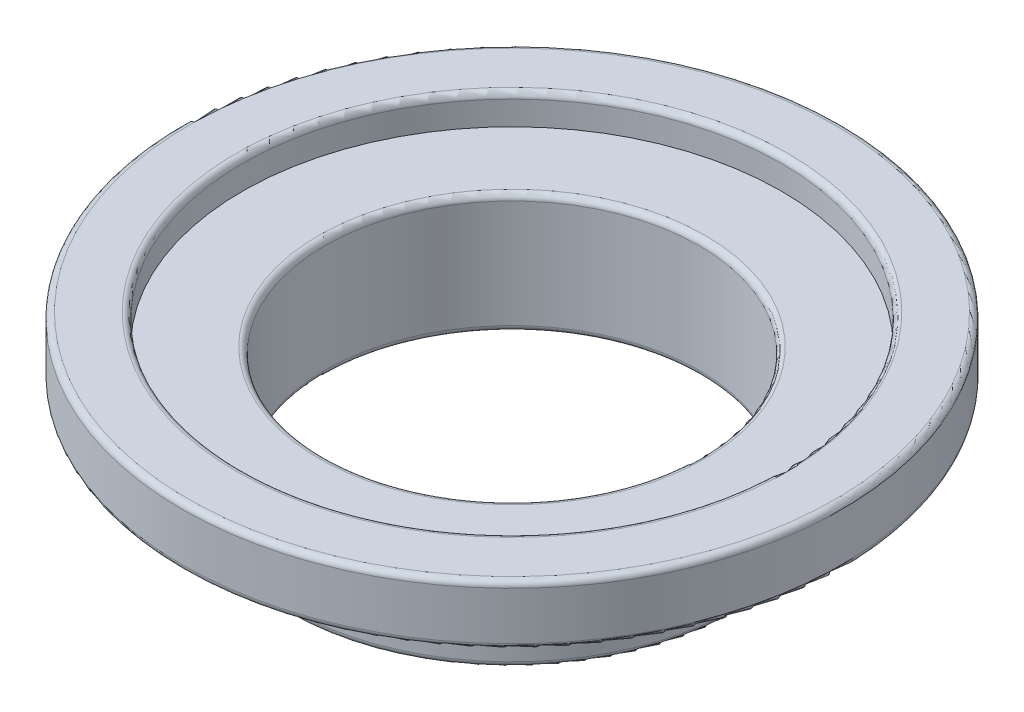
ISO-10303-21;
HEADER;
FILE_DESCRIPTION(('STEP AP214'),'2;1');
FILE_NAME('part.step','',(''),(''),'','','');
FILE_SCHEMA(('AUTOMOTIVE_DESIGN { 1 0 10303 214 1 1 1 1 }'));
ENDSEC;
DATA;
#1=APPLICATION_CONTEXT('core data for automotive mechanical design processes');
#2=APPLICATION_PROTOCOL_DEFINITION('international standard','automotive_design',2000,#1);
#3=PRODUCT_CONTEXT('',#1,'mechanical');
#4=PRODUCT('Part','Part','',(#3));
#5=PRODUCT_RELATED_PRODUCT_CATEGORY('part','',(#4));
#6=PRODUCT_DEFINITION_FORMATION('','',#4);
#7=PRODUCT_DEFINITION_CONTEXT('part definition',#1,'design');
#8=PRODUCT_DEFINITION('design','',#6,#7);
#9=PRODUCT_DEFINITION_SHAPE('','',#8);
#10=(LENGTH_UNIT() NAMED_UNIT(*) SI_UNIT(.MILLI.,.METRE.));
#11=(NAMED_UNIT(*) PLANE_ANGLE_UNIT() SI_UNIT($,.RADIAN.));
#12=(NAMED_UNIT(*) SI_UNIT($,.STERADIAN.) SOLID_ANGLE_UNIT());
#13=UNCERTAINTY_MEASURE_WITH_UNIT(LENGTH_MEASURE(1.E-05),#10,'distance_accuracy_value','');
#14=(GEOMETRIC_REPRESENTATION_CONTEXT(3) GLOBAL_UNCERTAINTY_ASSIGNED_CONTEXT((#13)) GLOBAL_UNIT_ASSIGNED_CONTEXT((#10,
#11,#12)) REPRESENTATION_CONTEXT('',''));
#15=CARTESIAN_POINT('',(0.,0.,0.));
#16=DIRECTION('',(0.,0.,1.));
#17=DIRECTION('',(1.,0.,0.));
#18=AXIS2_PLACEMENT_3D('',#15,#16,#17);
#19=CARTESIAN_POINT('',(0.,0.,0.));
#20=DIRECTION('',(0.,-1.,0.));
#21=DIRECTION('',(0.,0.,-1.00000000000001));
#22=AXIS2_PLACEMENT_3D('',#19,#20,#21);
#23=CYLINDRICAL_SURFACE('',#22,7.5);
#24=CARTESIAN_POINT('',(0.,5.45500000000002,0.));
#25=DIRECTION('',(0.,1.,0.));
#26=DIRECTION('',(0.,0.,1.00000000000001));
#27=AXIS2_PLACEMENT_3D('',#24,#25,#26);
#28=CIRCLE('',#27,7.5);
#29=CARTESIAN_POINT('',(0.,5.45500000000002,7.50000000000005));
#30=VERTEX_POINT('',#29);
#31=EDGE_CURVE('E44',#30,#30,#28,.T.);
#32=ORIENTED_EDGE('',*,*,#31,.T.);
#33=EDGE_LOOP('',(#32));
#34=FACE_BOUND('',#33,.T.);
#35=CARTESIAN_POINT('',(0.,8.25500000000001,0.));
#36=DIRECTION('',(0.,-1.,0.));
#37=DIRECTION('',(0.,0.,-1.00000000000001));
#38=AXIS2_PLACEMENT_3D('',#35,#36,#37);
#39=CIRCLE('',#38,7.5);
#40=CARTESIAN_POINT('',(0.,8.25500000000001,-7.50000000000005));
#41=VERTEX_POINT('',#40);
#42=EDGE_CURVE('E76',#41,#41,#39,.T.);
#43=ORIENTED_EDGE('',*,*,#42,.T.);
#44=EDGE_LOOP('',(#43));
#45=FACE_BOUND('',#44,.T.);
#46=ADVANCED_FACE('F29',(#34,#45),#23,.T.);
#47=CARTESIAN_POINT('',(0.,5.25500000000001,7.50000000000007));
#48=DIRECTION('',(0.,1.,0.));
#49=DIRECTION('',(0.,0.,1.00000000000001));
#50=AXIS2_PLACEMENT_3D('',#47,#48,#49);
#51=PLANE('',#50);
#52=CARTESIAN_POINT('',(0.,5.25500000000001,0.));
#53=DIRECTION('',(0.,1.,0.));
#54=DIRECTION('',(0.,0.,1.00000000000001));
#55=AXIS2_PLACEMENT_3D('',#52,#53,#54);
#56=CIRCLE('',#55,6.45);
#57=CARTESIAN_POINT('',(0.,5.25500000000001,6.45000000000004));
#58=VERTEX_POINT('',#57);
#59=EDGE_CURVE('E49',#58,#58,#56,.T.);
#60=ORIENTED_EDGE('',*,*,#59,.T.);
#61=EDGE_LOOP('',(#60));
#62=FACE_BOUND('',#61,.T.);
#63=CARTESIAN_POINT('',(0.,5.25500000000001,0.));
#64=DIRECTION('',(0.,1.,0.));
#65=DIRECTION('',(0.,0.,1.00000000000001));
#66=AXIS2_PLACEMENT_3D('',#63,#64,#65);
#67=CIRCLE('',#66,7.3);
#68=CARTESIAN_POINT('',(0.,5.25500000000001,7.30000000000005));
#69=VERTEX_POINT('',#68);
#70=EDGE_CURVE('E52',#69,#69,#67,.F.);
#71=ORIENTED_EDGE('',*,*,#70,.T.);
#72=EDGE_LOOP('',(#71));
#73=FACE_BOUND('',#72,.T.);
#74=ADVANCED_FACE('F96',(#62,#73),#51,.F.);
#75=CARTESIAN_POINT('',(0.,0.,0.));
#76=DIRECTION('',(0.,-1.,0.));
#77=DIRECTION('',(0.,0.,-1.00000000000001));
#78=AXIS2_PLACEMENT_3D('',#75,#76,#77);
#79=CYLINDRICAL_SURFACE('',#78,6.25);
#80=CARTESIAN_POINT('',(0.,9.05500000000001,0.));
#81=DIRECTION('',(0.,-1.,0.));
#82=DIRECTION('',(0.,0.,-1.00000000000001));
#83=AXIS2_PLACEMENT_3D('',#80,#81,#82);
#84=CIRCLE('',#83,6.25);
#85=CARTESIAN_POINT('',(0.,9.05500000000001,-6.25000000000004));
#86=VERTEX_POINT('',#85);
#87=EDGE_CURVE('E55',#86,#86,#84,.F.);
#88=ORIENTED_EDGE('',*,*,#87,.T.);
#89=EDGE_LOOP('',(#88));
#90=FACE_BOUND('',#89,.T.);
#91=CARTESIAN_POINT('',(0.,5.45500000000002,0.));
#92=DIRECTION('',(0.,1.,0.));
#93=DIRECTION('',(0.,0.,1.00000000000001));
#94=AXIS2_PLACEMENT_3D('',#91,#92,#93);
#95=CIRCLE('',#94,6.25);
#96=CARTESIAN_POINT('',(0.,5.45500000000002,6.25000000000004));
#97=VERTEX_POINT('',#96);
#98=EDGE_CURVE('E58',#97,#97,#95,.F.);
#99=ORIENTED_EDGE('',*,*,#98,.T.);
#100=EDGE_LOOP('',(#99));
#101=FACE_BOUND('',#100,.T.);
#102=ADVANCED_FACE('F102',(#90,#101),#79,.F.);
#103=CARTESIAN_POINT('',(0.,9.25500000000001,6.25000000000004));
#104=DIRECTION('',(0.,-1.,0.));
#105=DIRECTION('',(0.,0.,-1.00000000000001));
#106=AXIS2_PLACEMENT_3D('',#103,#104,#105);
#107=PLANE('',#106);
#108=CARTESIAN_POINT('',(0.,9.25500000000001,0.));
#109=DIRECTION('',(0.,-1.,0.));
#110=DIRECTION('',(0.,0.,-1.00000000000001));
#111=AXIS2_PLACEMENT_3D('',#108,#109,#110);
#112=CIRCLE('',#111,6.45);
#113=CARTESIAN_POINT('',(0.,9.25500000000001,-6.45000000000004));
#114=VERTEX_POINT('',#113);
#115=EDGE_CURVE('E61',#114,#114,#112,.T.);
#116=ORIENTED_EDGE('',*,*,#115,.T.);
#117=EDGE_LOOP('',(#116));
#118=FACE_BOUND('',#117,.T.);
#119=CARTESIAN_POINT('',(0.,9.25500000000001,0.));
#120=DIRECTION('',(0.,-1.,0.));
#121=DIRECTION('',(0.,0.,-1.00000000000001));
#122=AXIS2_PLACEMENT_3D('',#119,#120,#121);
#123=CIRCLE('',#122,9.);
#124=CARTESIAN_POINT('',(0.,9.25500000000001,-9.00000000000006));
#125=VERTEX_POINT('',#124);
#126=EDGE_CURVE('E73',#125,#125,#123,.T.);
#127=ORIENTED_EDGE('',*,*,#126,.F.);
#128=EDGE_LOOP('',(#127));
#129=FACE_BOUND('',#128,.T.);
#130=ADVANCED_FACE('F134',(#118,#129),#107,.F.);
#131=CARTESIAN_POINT('',(0.,0.,0.));
#132=DIRECTION('',(0.,-1.,0.));
#133=DIRECTION('',(0.,0.,-1.00000000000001));
#134=AXIS2_PLACEMENT_3D('',#131,#132,#133);
#135=CYLINDRICAL_SURFACE('',#134,9.);
#136=CARTESIAN_POINT('',(0.,10.055,0.));
#137=DIRECTION('',(0.,-1.,0.));
#138=DIRECTION('',(0.,0.,-1.00000000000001));
#139=AXIS2_PLACEMENT_3D('',#136,#137,#138);
#140=CIRCLE('',#139,9.);
#141=CARTESIAN_POINT('',(0.,10.055,-9.00000000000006));
#142=VERTEX_POINT('',#141);
#143=EDGE_CURVE('E64',#142,#142,#140,.F.);
#144=ORIENTED_EDGE('',*,*,#143,.T.);
#145=EDGE_LOOP('',(#144));
#146=FACE_BOUND('',#145,.T.);
#147=ORIENTED_EDGE('',*,*,#126,.T.);
#148=EDGE_LOOP('',(#147));
#149=FACE_BOUND('',#148,.T.);
#150=ADVANCED_FACE('F128',(#146,#149),#135,.F.);
#151=CARTESIAN_POINT('',(0.,10.255,9.00000000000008));
#152=DIRECTION('',(0.,-1.,0.));
#153=DIRECTION('',(0.,0.,-1.00000000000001));
#154=AXIS2_PLACEMENT_3D('',#151,#152,#153);
#155=PLANE('',#154);
#156=CARTESIAN_POINT('',(0.,10.255,0.));
#157=DIRECTION('',(0.,-1.,0.));
#158=DIRECTION('',(0.,0.,-1.00000000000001));
#159=AXIS2_PLACEMENT_3D('',#156,#157,#158);
#160=CIRCLE('',#159,9.2);
#161=CARTESIAN_POINT('',(0.,10.255,-9.20000000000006));
#162=VERTEX_POINT('',#161);
#163=EDGE_CURVE('E67',#162,#162,#160,.T.);
#164=ORIENTED_EDGE('',*,*,#163,.T.);
#165=EDGE_LOOP('',(#164));
#166=FACE_BOUND('',#165,.T.);
#167=CARTESIAN_POINT('',(0.,10.255,0.));
#168=DIRECTION('',(0.,-1.,0.));
#169=DIRECTION('',(0.,0.,-1.00000000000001));
#170=AXIS2_PLACEMENT_3D('',#167,#168,#169);
#171=CIRCLE('',#170,10.8);
#172=CARTESIAN_POINT('',(0.,10.255,-10.8000000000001));
#173=VERTEX_POINT('',#172);
#174=EDGE_CURVE('E70',#173,#173,#171,.F.);
#175=ORIENTED_EDGE('',*,*,#174,.T.);
#176=EDGE_LOOP('',(#175));
#177=FACE_BOUND('',#176,.T.);
#178=ADVANCED_FACE('F93',(#166,#177),#155,.F.);
#179=CARTESIAN_POINT('',(0.,0.,0.));
#180=DIRECTION('',(0.,-1.,0.));
#181=DIRECTION('',(0.,0.,-1.00000000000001));
#182=AXIS2_PLACEMENT_3D('',#179,#180,#181);
#183=CYLINDRICAL_SURFACE('',#182,11.);
#184=CARTESIAN_POINT('',(0.,10.055,0.));
#185=DIRECTION('',(0.,-1.,0.));
#186=DIRECTION('',(0.,0.,-1.00000000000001));
#187=AXIS2_PLACEMENT_3D('',#184,#185,#186);
#188=CIRCLE('',#187,11.);
#189=CARTESIAN_POINT('',(0.,10.055,-11.0000000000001));
#190=VERTEX_POINT('',#189);
#191=EDGE_CURVE('E36',#190,#190,#188,.T.);
#192=ORIENTED_EDGE('',*,*,#191,.T.);
#193=EDGE_LOOP('',(#192));
#194=FACE_BOUND('',#193,.T.);
#195=CARTESIAN_POINT('',(0.,8.45500000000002,0.));
#196=DIRECTION('',(0.,1.,0.));
#197=DIRECTION('',(0.,0.,1.00000000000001));
#198=AXIS2_PLACEMENT_3D('',#195,#196,#197);
#199=CIRCLE('',#198,11.);
#200=CARTESIAN_POINT('',(0.,8.45500000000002,11.0000000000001));
#201=VERTEX_POINT('',#200);
#202=EDGE_CURVE('E40',#201,#201,#199,.T.);
#203=ORIENTED_EDGE('',*,*,#202,.T.);
#204=EDGE_LOOP('',(#203));
#205=FACE_BOUND('',#204,.T.);
#206=ADVANCED_FACE('F84',(#194,#205),#183,.T.);
#207=CARTESIAN_POINT('',(0.,8.25500000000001,11.0000000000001));
#208=DIRECTION('',(0.,1.,0.));
#209=DIRECTION('',(0.,0.,1.00000000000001));
#210=AXIS2_PLACEMENT_3D('',#207,#208,#209);
#211=PLANE('',#210);
#212=CARTESIAN_POINT('',(0.,8.25500000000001,0.));
#213=DIRECTION('',(0.,1.,0.));
#214=DIRECTION('',(0.,0.,1.00000000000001));
#215=AXIS2_PLACEMENT_3D('',#212,#213,#214);
#216=CIRCLE('',#215,10.8);
#217=CARTESIAN_POINT('',(0.,8.25500000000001,10.8000000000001));
#218=VERTEX_POINT('',#217);
#219=EDGE_CURVE('E10',#218,#218,#216,.F.);
#220=ORIENTED_EDGE('',*,*,#219,.T.);
#221=EDGE_LOOP('',(#220));
#222=FACE_BOUND('',#221,.T.);
#223=ORIENTED_EDGE('',*,*,#42,.F.);
#224=EDGE_LOOP('',(#223));
#225=FACE_BOUND('',#224,.T.);
#226=ADVANCED_FACE('F81',(#222,#225),#211,.F.);
#227=CARTESIAN_POINT('',(0.,10.055,0.));
#228=DIRECTION('',(0.,-1.,0.));
#229=DIRECTION('',(0.,0.,-1.00000000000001));
#230=AXIS2_PLACEMENT_3D('',#227,#228,#229);
#231=TOROIDAL_SURFACE('',#230,9.2,0.2);
#232=ORIENTED_EDGE('',*,*,#143,.F.);
#233=EDGE_LOOP('',(#232));
#234=FACE_BOUND('',#233,.T.);
#235=ORIENTED_EDGE('',*,*,#163,.F.);
#236=EDGE_LOOP('',(#235));
#237=FACE_BOUND('',#236,.T.);
#238=ADVANCED_FACE('F83',(#234,#237),#231,.T.);
#239=CARTESIAN_POINT('',(0.,9.05500000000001,0.));
#240=DIRECTION('',(0.,-1.,0.));
#241=DIRECTION('',(0.,0.,-1.00000000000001));
#242=AXIS2_PLACEMENT_3D('',#239,#240,#241);
#243=TOROIDAL_SURFACE('',#242,6.45,0.2);
#244=ORIENTED_EDGE('',*,*,#87,.F.);
#245=EDGE_LOOP('',(#244));
#246=FACE_BOUND('',#245,.T.);
#247=ORIENTED_EDGE('',*,*,#115,.F.);
#248=EDGE_LOOP('',(#247));
#249=FACE_BOUND('',#248,.T.);
#250=ADVANCED_FACE('F90',(#246,#249),#243,.T.);
#251=CARTESIAN_POINT('',(0.,5.45500000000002,0.));
#252=DIRECTION('',(0.,1.,0.));
#253=DIRECTION('',(0.,0.,1.00000000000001));
#254=AXIS2_PLACEMENT_3D('',#251,#252,#253);
#255=TOROIDAL_SURFACE('',#254,6.45,0.2);
#256=ORIENTED_EDGE('',*,*,#59,.F.);
#257=EDGE_LOOP('',(#256));
#258=FACE_BOUND('',#257,.T.);
#259=ORIENTED_EDGE('',*,*,#98,.F.);
#260=EDGE_LOOP('',(#259));
#261=FACE_BOUND('',#260,.T.);
#262=ADVANCED_FACE('F109',(#258,#261),#255,.T.);
#263=CARTESIAN_POINT('',(0.,5.45500000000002,0.));
#264=DIRECTION('',(0.,1.,0.));
#265=DIRECTION('',(0.,0.,1.00000000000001));
#266=AXIS2_PLACEMENT_3D('',#263,#264,#265);
#267=TOROIDAL_SURFACE('',#266,7.3,0.2);
#268=ORIENTED_EDGE('',*,*,#31,.F.);
#269=EDGE_LOOP('',(#268));
#270=FACE_BOUND('',#269,.T.);
#271=ORIENTED_EDGE('',*,*,#70,.F.);
#272=EDGE_LOOP('',(#271));
#273=FACE_BOUND('',#272,.T.);
#274=ADVANCED_FACE('F113',(#270,#273),#267,.T.);
#275=CARTESIAN_POINT('',(0.,10.055,0.));
#276=DIRECTION('',(0.,-1.,0.));
#277=DIRECTION('',(0.,0.,-1.00000000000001));
#278=AXIS2_PLACEMENT_3D('',#275,#276,#277);
#279=TOROIDAL_SURFACE('',#278,10.8,0.2);
#280=ORIENTED_EDGE('',*,*,#174,.F.);
#281=EDGE_LOOP('',(#280));
#282=FACE_BOUND('',#281,.T.);
#283=ORIENTED_EDGE('',*,*,#191,.F.);
#284=EDGE_LOOP('',(#283));
#285=FACE_BOUND('',#284,.T.);
#286=ADVANCED_FACE('F116',(#282,#285),#279,.T.);
#287=CARTESIAN_POINT('',(0.,8.45500000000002,0.));
#288=DIRECTION('',(0.,1.,0.));
#289=DIRECTION('',(0.,0.,1.00000000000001));
#290=AXIS2_PLACEMENT_3D('',#287,#288,#289);
#291=TOROIDAL_SURFACE('',#290,10.8,0.2);
#292=ORIENTED_EDGE('',*,*,#202,.F.);
#293=EDGE_LOOP('',(#292));
#294=FACE_BOUND('',#293,.T.);
#295=ORIENTED_EDGE('',*,*,#219,.F.);
#296=EDGE_LOOP('',(#295));
#297=FACE_BOUND('',#296,.T.);
#298=ADVANCED_FACE('F31',(#294,#297),#291,.T.);
#299=CLOSED_SHELL('',(#46,#74,#102,#130,#150,#178,#206,#226,#238,#250,#262,#274,#286,#298));
#300=MANIFOLD_SOLID_BREP('B2',#299);
#301=ADVANCED_BREP_SHAPE_REPRESENTATION('',(#18,#300),#14);
#302=SHAPE_DEFINITION_REPRESENTATION(#9,#301);
ENDSEC;
END-ISO-10303-21;
